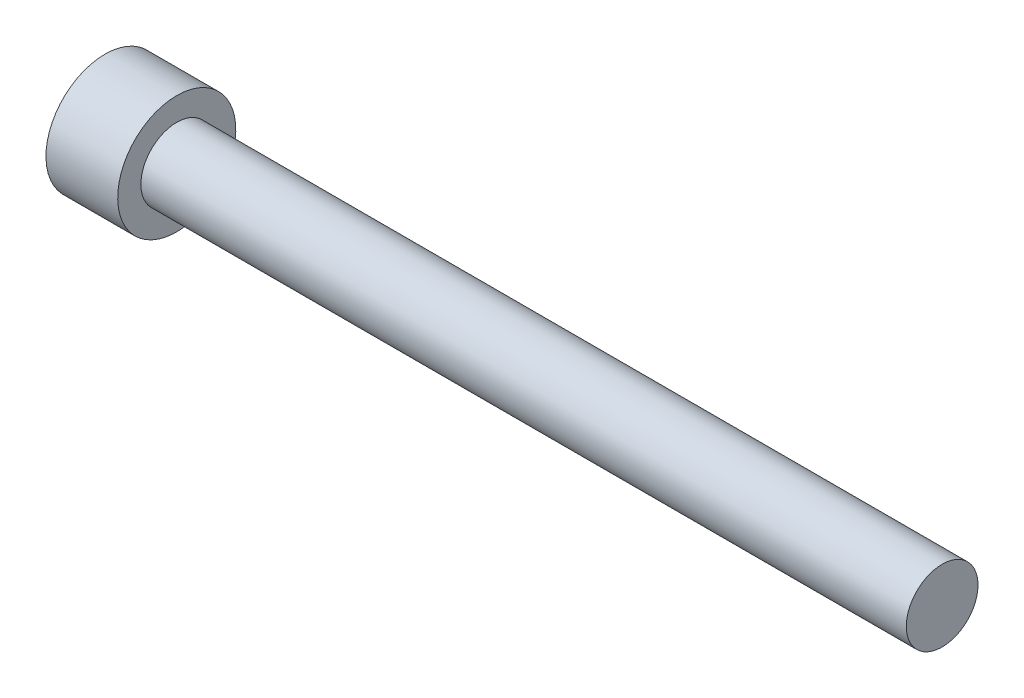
from build123d import *

# Parameters (mm, degrees)
CUT_EXTRUDE1_DEPTH = 4.826


with BuildPart() as part:
    # Sketch1 → Revolve1 (revolve)
    with BuildSketch(Plane.XY):
        Polygon((48.6156, 0), (0, 0), (0, 3.429), (4.1656, 3.429), (4.1656, 2.0828), (48.6156, 2.0828), align=None)
    revolve(axis=Axis((48.6156, 0, 0), (-1, 0, 0)))

    # Sketch2 → Cut-Extrude1 (cut)
    with BuildSketch(Plane.ZY):
        Polygon((2.062222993, 0), (1.031111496, 1.7859375), (-1.031111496, 1.7859375), (-2.062222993, 0), (-1.031111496, -1.7859375), (1.031111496, -1.7859375), align=None)
    extrude(amount=-CUT_EXTRUDE1_DEPTH, mode=Mode.SUBTRACT)


solid = part.part
